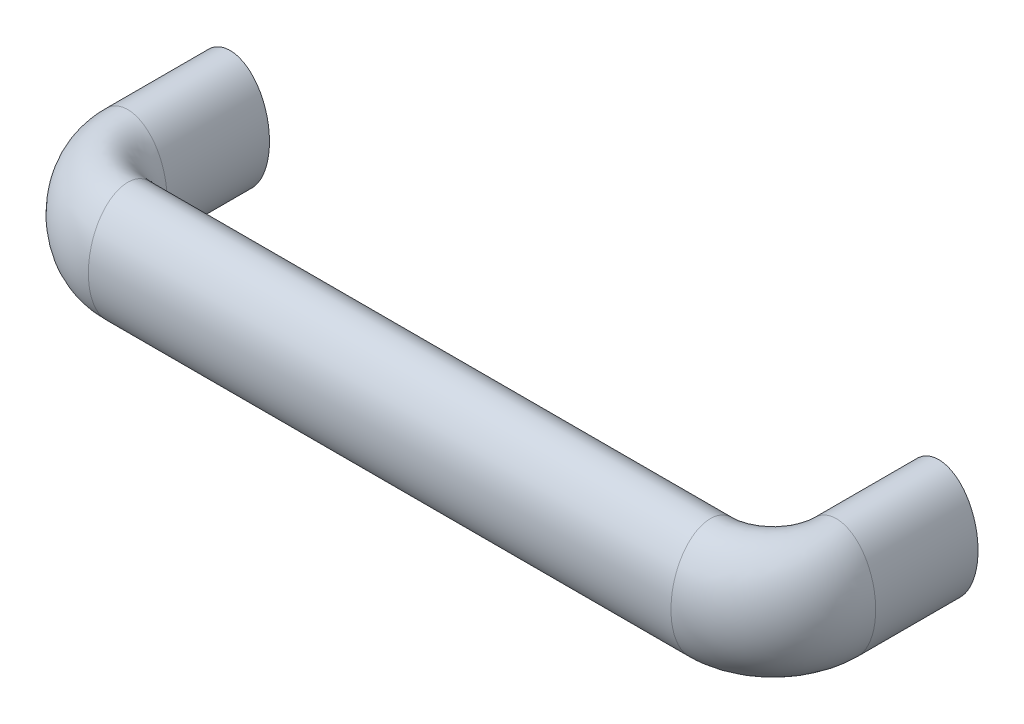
ISO-10303-21;
HEADER;
FILE_DESCRIPTION(('STEP AP214'),'2;1');
FILE_NAME('part.step','',(''),(''),'','','');
FILE_SCHEMA(('AUTOMOTIVE_DESIGN { 1 0 10303 214 1 1 1 1 }'));
ENDSEC;
DATA;
#1=APPLICATION_CONTEXT('core data for automotive mechanical design processes');
#2=APPLICATION_PROTOCOL_DEFINITION('international standard','automotive_design',2000,#1);
#3=PRODUCT_CONTEXT('',#1,'mechanical');
#4=PRODUCT('Part','Part','',(#3));
#5=PRODUCT_RELATED_PRODUCT_CATEGORY('part','',(#4));
#6=PRODUCT_DEFINITION_FORMATION('','',#4);
#7=PRODUCT_DEFINITION_CONTEXT('part definition',#1,'design');
#8=PRODUCT_DEFINITION('design','',#6,#7);
#9=PRODUCT_DEFINITION_SHAPE('','',#8);
#10=(LENGTH_UNIT() NAMED_UNIT(*) SI_UNIT(.MILLI.,.METRE.));
#11=(NAMED_UNIT(*) PLANE_ANGLE_UNIT() SI_UNIT($,.RADIAN.));
#12=(NAMED_UNIT(*) SI_UNIT($,.STERADIAN.) SOLID_ANGLE_UNIT());
#13=UNCERTAINTY_MEASURE_WITH_UNIT(LENGTH_MEASURE(1.E-05),#10,'distance_accuracy_value','');
#14=(GEOMETRIC_REPRESENTATION_CONTEXT(3) GLOBAL_UNCERTAINTY_ASSIGNED_CONTEXT((#13)) GLOBAL_UNIT_ASSIGNED_CONTEXT((#10,
#11,#12)) REPRESENTATION_CONTEXT('',''));
#15=CARTESIAN_POINT('',(0.,0.,0.));
#16=DIRECTION('',(0.,0.,1.));
#17=DIRECTION('',(1.,0.,0.));
#18=AXIS2_PLACEMENT_3D('',#15,#16,#17);
#19=CARTESIAN_POINT('',(179.5,0.,0.));
#20=DIRECTION('',(0.,0.,-1.));
#21=DIRECTION('',(-1.,0.,0.));
#22=AXIS2_PLACEMENT_3D('',#19,#20,#21);
#23=PLANE('',#22);
#24=CARTESIAN_POINT('',(179.5,0.,0.));
#25=DIRECTION('',(0.,0.,-1.));
#26=DIRECTION('',(0.,-1.,0.));
#27=AXIS2_PLACEMENT_3D('',#24,#25,#26);
#28=ELLIPSE('',#27,15.,10.);
#29=CARTESIAN_POINT('',(179.5,-15.,0.));
#30=VERTEX_POINT('',#29);
#31=EDGE_CURVE('E8',#30,#30,#28,.T.);
#32=ORIENTED_EDGE('',*,*,#31,.T.);
#33=EDGE_LOOP('',(#32));
#34=FACE_BOUND('',#33,.T.);
#35=CARTESIAN_POINT('',(179.,0.,0.));
#36=DIRECTION('',(0.,0.,1.));
#37=DIRECTION('',(1.,0.,0.));
#38=AXIS2_PLACEMENT_3D('',#35,#36,#37);
#39=CIRCLE('',#38,4.);
#40=CARTESIAN_POINT('',(183.,0.,0.));
#41=VERTEX_POINT('',#40);
#42=EDGE_CURVE('E67',#41,#41,#39,.T.);
#43=ORIENTED_EDGE('',*,*,#42,.T.);
#44=EDGE_LOOP('',(#43));
#45=FACE_BOUND('',#44,.T.);
#46=ADVANCED_FACE('F12',(#34,#45),#23,.T.);
#47=CARTESIAN_POINT('',(-0.5,0.,0.));
#48=DIRECTION('',(0.,0.,1.));
#49=DIRECTION('',(1.,0.,0.));
#50=AXIS2_PLACEMENT_3D('',#47,#48,#49);
#51=PLANE('',#50);
#52=CARTESIAN_POINT('',(-0.5,0.,0.));
#53=DIRECTION('',(0.,0.,1.));
#54=DIRECTION('',(0.,-1.,0.));
#55=AXIS2_PLACEMENT_3D('',#52,#53,#54);
#56=ELLIPSE('',#55,15.,10.);
#57=CARTESIAN_POINT('',(-0.500000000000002,-15.,0.));
#58=VERTEX_POINT('',#57);
#59=EDGE_CURVE('E53',#58,#58,#56,.T.);
#60=ORIENTED_EDGE('',*,*,#59,.F.);
#61=EDGE_LOOP('',(#60));
#62=FACE_BOUND('',#61,.T.);
#63=CARTESIAN_POINT('',(0.,0.,0.));
#64=DIRECTION('',(0.,0.,1.));
#65=DIRECTION('',(1.,0.,0.));
#66=AXIS2_PLACEMENT_3D('',#63,#64,#65);
#67=CIRCLE('',#66,4.);
#68=CARTESIAN_POINT('',(4.,0.,0.));
#69=VERTEX_POINT('',#68);
#70=EDGE_CURVE('E54',#69,#69,#67,.T.);
#71=ORIENTED_EDGE('',*,*,#70,.T.);
#72=EDGE_LOOP('',(#71));
#73=FACE_BOUND('',#72,.T.);
#74=ADVANCED_FACE('F86',(#62,#73),#51,.F.);
#75=CARTESIAN_POINT('',(179.5,0.,26.));
#76=DIRECTION('',(0.,0.,-1.));
#77=DIRECTION('',(0.,-1.,0.));
#78=AXIS2_PLACEMENT_3D('',#75,#76,#77);
#79=ELLIPSE('',#78,15.,10.);
#80=DIRECTION('',(0.,0.,-1.));
#81=VECTOR('',#80,1.);
#82=SURFACE_OF_LINEAR_EXTRUSION('',#79,#81);
#83=CARTESIAN_POINT('',(179.5,-15.,26.));
#84=VERTEX_POINT('',#83);
#85=EDGE_CURVE('E19',#84,#84,#79,.T.);
#86=ORIENTED_EDGE('',*,*,#85,.T.);
#87=EDGE_LOOP('',(#86));
#88=FACE_BOUND('',#87,.T.);
#89=ORIENTED_EDGE('',*,*,#31,.F.);
#90=EDGE_LOOP('',(#89));
#91=FACE_BOUND('',#90,.T.);
#92=ADVANCED_FACE('F14',(#88,#91),#82,.T.);
#93=CARTESIAN_POINT('',(163.5,0.,42.));
#94=DIRECTION('',(1.,0.,0.));
#95=DIRECTION('',(0.,-1.,0.));
#96=AXIS2_PLACEMENT_3D('',#93,#94,#95);
#97=ELLIPSE('',#96,15.,10.);
#98=CARTESIAN_POINT('',(163.5,0.,26.));
#99=DIRECTION('',(0.,1.,0.));
#100=AXIS1_PLACEMENT('',#98,#99);
#101=SURFACE_OF_REVOLUTION('',#97,#100);
#102=CARTESIAN_POINT('',(163.5,-15.,42.));
#103=VERTEX_POINT('',#102);
#104=EDGE_CURVE('E23',#103,#103,#97,.T.);
#105=ORIENTED_EDGE('',*,*,#104,.T.);
#106=EDGE_LOOP('',(#105));
#107=FACE_BOUND('',#106,.T.);
#108=ORIENTED_EDGE('',*,*,#85,.F.);
#109=EDGE_LOOP('',(#108));
#110=FACE_BOUND('',#109,.T.);
#111=ADVANCED_FACE('F34',(#107,#110),#101,.F.);
#112=CARTESIAN_POINT('',(15.5,0.,42.));
#113=DIRECTION('',(1.,0.,0.));
#114=DIRECTION('',(0.,-1.,0.));
#115=AXIS2_PLACEMENT_3D('',#112,#113,#114);
#116=ELLIPSE('',#115,15.,10.);
#117=DIRECTION('',(1.,0.,0.));
#118=VECTOR('',#117,1.);
#119=SURFACE_OF_LINEAR_EXTRUSION('',#116,#118);
#120=CARTESIAN_POINT('',(15.5,-15.,42.));
#121=VERTEX_POINT('',#120);
#122=EDGE_CURVE('E27',#121,#121,#116,.T.);
#123=ORIENTED_EDGE('',*,*,#122,.T.);
#124=EDGE_LOOP('',(#123));
#125=FACE_BOUND('',#124,.T.);
#126=ORIENTED_EDGE('',*,*,#104,.F.);
#127=EDGE_LOOP('',(#126));
#128=FACE_BOUND('',#127,.T.);
#129=ADVANCED_FACE('F37',(#125,#128),#119,.T.);
#130=CARTESIAN_POINT('',(-0.5,0.,26.));
#131=DIRECTION('',(0.,0.,1.));
#132=DIRECTION('',(0.,-1.,0.));
#133=AXIS2_PLACEMENT_3D('',#130,#131,#132);
#134=ELLIPSE('',#133,15.,10.);
#135=CARTESIAN_POINT('',(15.5,0.,26.));
#136=DIRECTION('',(0.,1.,0.));
#137=AXIS1_PLACEMENT('',#135,#136);
#138=SURFACE_OF_REVOLUTION('',#134,#137);
#139=CARTESIAN_POINT('',(-0.500000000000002,-15.,26.));
#140=VERTEX_POINT('',#139);
#141=EDGE_CURVE('E49',#140,#140,#134,.T.);
#142=ORIENTED_EDGE('',*,*,#141,.T.);
#143=EDGE_LOOP('',(#142));
#144=FACE_BOUND('',#143,.T.);
#145=ORIENTED_EDGE('',*,*,#122,.F.);
#146=EDGE_LOOP('',(#145));
#147=FACE_BOUND('',#146,.T.);
#148=ADVANCED_FACE('F41',(#144,#147),#138,.F.);
#149=DIRECTION('',(0.,0.,-1.));
#150=VECTOR('',#149,1.);
#151=SURFACE_OF_LINEAR_EXTRUSION('',#134,#150);
#152=ORIENTED_EDGE('',*,*,#141,.F.);
#153=EDGE_LOOP('',(#152));
#154=FACE_BOUND('',#153,.T.);
#155=ORIENTED_EDGE('',*,*,#59,.T.);
#156=EDGE_LOOP('',(#155));
#157=FACE_BOUND('',#156,.T.);
#158=ADVANCED_FACE('F46',(#154,#157),#151,.F.);
#159=CARTESIAN_POINT('',(0.,0.,13.));
#160=DIRECTION('',(0.,0.,-1.));
#161=DIRECTION('',(-1.,0.,0.));
#162=AXIS2_PLACEMENT_3D('',#159,#160,#161);
#163=CYLINDRICAL_SURFACE('',#162,4.);
#164=CARTESIAN_POINT('',(0.,0.,13.));
#165=DIRECTION('',(0.,0.,1.));
#166=DIRECTION('',(1.,0.,0.));
#167=AXIS2_PLACEMENT_3D('',#164,#165,#166);
#168=CIRCLE('',#167,4.);
#169=CARTESIAN_POINT('',(4.,0.,13.));
#170=VERTEX_POINT('',#169);
#171=EDGE_CURVE('E58',#170,#170,#168,.T.);
#172=ORIENTED_EDGE('',*,*,#171,.T.);
#173=EDGE_LOOP('',(#172));
#174=FACE_BOUND('',#173,.T.);
#175=ORIENTED_EDGE('',*,*,#70,.F.);
#176=EDGE_LOOP('',(#175));
#177=FACE_BOUND('',#176,.T.);
#178=ADVANCED_FACE('F94',(#174,#177),#163,.F.);
#179=CARTESIAN_POINT('',(0.,0.,13.));
#180=DIRECTION('',(0.,0.,1.));
#181=DIRECTION('',(1.,0.,0.));
#182=AXIS2_PLACEMENT_3D('',#179,#180,#181);
#183=PLANE('',#182);
#184=ORIENTED_EDGE('',*,*,#171,.F.);
#185=EDGE_LOOP('',(#184));
#186=FACE_BOUND('',#185,.T.);
#187=ADVANCED_FACE('F83',(#186),#183,.F.);
#188=CARTESIAN_POINT('',(179.,0.,13.));
#189=DIRECTION('',(0.,0.,-1.));
#190=DIRECTION('',(-1.,0.,0.));
#191=AXIS2_PLACEMENT_3D('',#188,#189,#190);
#192=CYLINDRICAL_SURFACE('',#191,4.);
#193=CARTESIAN_POINT('',(179.,0.,13.));
#194=DIRECTION('',(0.,0.,1.));
#195=DIRECTION('',(1.,0.,0.));
#196=AXIS2_PLACEMENT_3D('',#193,#194,#195);
#197=CIRCLE('',#196,4.);
#198=CARTESIAN_POINT('',(183.,0.,13.));
#199=VERTEX_POINT('',#198);
#200=EDGE_CURVE('E65',#199,#199,#197,.T.);
#201=ORIENTED_EDGE('',*,*,#200,.T.);
#202=EDGE_LOOP('',(#201));
#203=FACE_BOUND('',#202,.T.);
#204=ORIENTED_EDGE('',*,*,#42,.F.);
#205=EDGE_LOOP('',(#204));
#206=FACE_BOUND('',#205,.T.);
#207=ADVANCED_FACE('F73',(#203,#206),#192,.F.);
#208=CARTESIAN_POINT('',(179.,0.,13.));
#209=DIRECTION('',(0.,0.,1.));
#210=DIRECTION('',(1.,0.,0.));
#211=AXIS2_PLACEMENT_3D('',#208,#209,#210);
#212=PLANE('',#211);
#213=ORIENTED_EDGE('',*,*,#200,.F.);
#214=EDGE_LOOP('',(#213));
#215=FACE_BOUND('',#214,.T.);
#216=ADVANCED_FACE('F76',(#215),#212,.F.);
#217=CLOSED_SHELL('',(#46,#74,#92,#111,#129,#148,#158,#178,#187,#207,#216));
#218=MANIFOLD_SOLID_BREP('B1',#217);
#219=ADVANCED_BREP_SHAPE_REPRESENTATION('',(#18,#218),#14);
#220=SHAPE_DEFINITION_REPRESENTATION(#9,#219);
ENDSEC;
END-ISO-10303-21;
